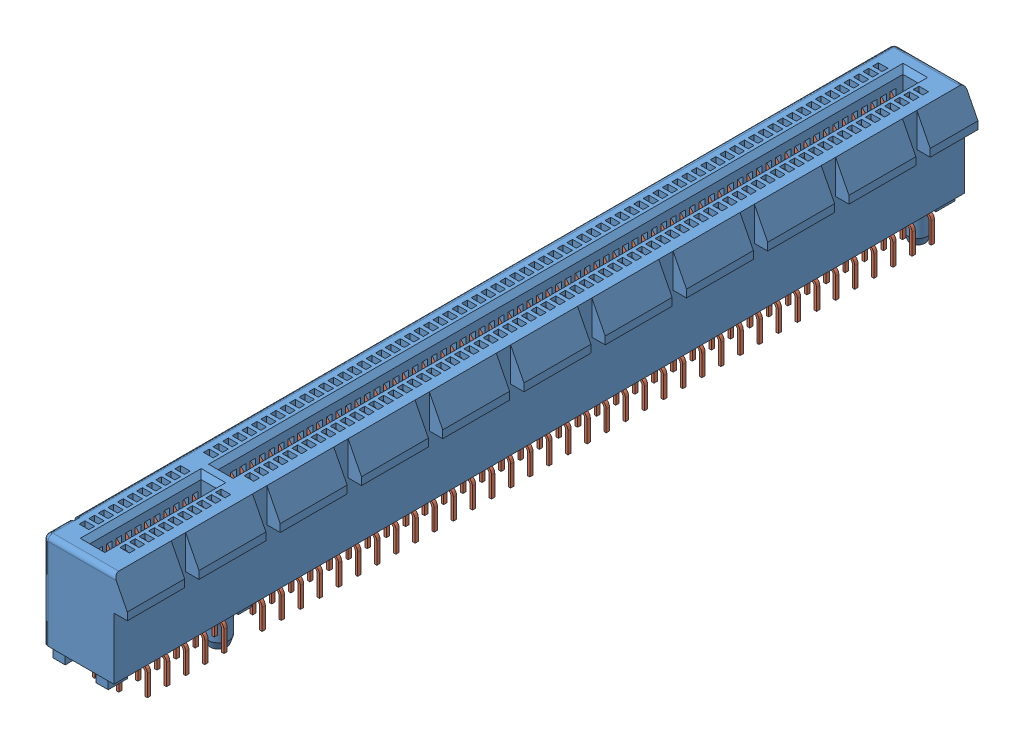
SolidWorks assembly TE PCIe Express Assembly.SLDASM, configuration PCIe x16 (2.3mm Pins) (file format 6000). Lengths in mm.
Overall size (8.8 15.4 89).
165 component instances, 2 part files, 7 mates.
Components (placement in the parent):
- PCIe Body-1: PCIe Body.SLDPRT [PCIe x16] at origin size (8.8 15.4 89)
- Pins-1: Pins.SLDPRT [Internal Pin (Short)] at (2.25 -3.3 85.83) size (1.88 12.9 0.34)
- Pins-2: Pins.SLDPRT [Internal Pin (Short)] at (-2.25 -3.3 86.17) x (-1 0 0) z (0 0 -1) size (1.88 12.9 0.34)
- Pins-3: Pins.SLDPRT [Internal Pin (Short)] at (2.25 -3.3 83.83) size (1.88 12.9 0.34)
- Pins-4: Pins.SLDPRT [Internal Pin (Short)] at (2.25 -3.3 81.83) size (1.88 12.9 0.34)
- Pins-5: Pins.SLDPRT [Internal Pin (Short)] at (2.25 -3.3 79.83) size (1.88 12.9 0.34)
- Pins-6: Pins.SLDPRT [Internal Pin (Short)] at (2.25 -3.3 77.83) size (1.88 12.9 0.34)
- Pins-7: Pins.SLDPRT [Internal Pin (Short)] at (2.25 -3.3 75.83) size (1.88 12.9 0.34)
- Pins-8: Pins.SLDPRT [Internal Pin (Short)] at (2.25 -3.3 71.83) size (1.88 12.9 0.34)
- Pins-9: Pins.SLDPRT [Internal Pin (Short)] at (2.25 -3.3 69.83) size (1.88 12.9 0.34)
- Pins-10: Pins.SLDPRT [Internal Pin (Short)] at (2.25 -3.3 67.83) size (1.88 12.9 0.34)
- Pins-11: Pins.SLDPRT [Internal Pin (Short)] at (-2.25 -3.3 84.17) x (-1 0 0) z (0 0 -1) size (1.88 12.9 0.34)
- Pins-12: Pins.SLDPRT [Internal Pin (Short)] at (-2.25 -3.3 82.17) x (-1 0 0) z (0 0 -1) size (1.88 12.9 0.34)
- Pins-13: Pins.SLDPRT [Internal Pin (Short)] at (-2.25 -3.3 80.17) x (-1 0 0) z (0 0 -1) size (1.88 12.9 0.34)
- Pins-14: Pins.SLDPRT [Internal Pin (Short)] at (-2.25 -3.3 78.17) x (-1 0 0) z (0 0 -1) size (1.88 12.9 0.34)
- Pins-15: Pins.SLDPRT [Internal Pin (Short)] at (-2.25 -3.3 76.17) x (-1 0 0) z (0 0 -1) size (1.88 12.9 0.34)
- Pins-16: Pins.SLDPRT [Internal Pin (Short)] at (-2.25 -3.3 72.17) x (-1 0 0) z (0 0 -1) size (1.88 12.9 0.34)
- Pins-17: Pins.SLDPRT [Internal Pin (Short)] at (-2.25 -3.3 70.17) x (-1 0 0) z (0 0 -1) size (1.88 12.9 0.34)
- Pins-18: Pins.SLDPRT [Internal Pin (Short)] at (-2.25 -3.3 68.17) x (-1 0 0) z (0 0 -1) size (1.88 12.9 0.34)
- Pins-19: Pins.SLDPRT [External Pin (Short)] at (2.25 -3.3 84.83) size (2.88 12.9 0.34)
- Pins-20: Pins.SLDPRT [External Pin (Short)] at (-2.25 -3.3 85.17) x (-1 0 0) z (0 0 -1) size (2.88 12.9 0.34)
- Pins-21: Pins.SLDPRT [External Pin (Short)] at (-2.25 -3.3 83.17) x (-1 0 0) z (0 0 -1) size (2.88 12.9 0.34)
- Pins-22: Pins.SLDPRT [External Pin (Short)] at (-2.25 -3.3 81.17) x (-1 0 0) z (0 0 -1) size (2.88 12.9 0.34)
- Pins-23: Pins.SLDPRT [External Pin (Short)] at (-2.25 -3.3 79.17) x (-1 0 0) z (0 0 -1) size (2.88 12.9 0.34)
- Pins-24: Pins.SLDPRT [External Pin (Short)] at (-2.25 -3.3 77.17) x (-1 0 0) z (0 0 -1) size (2.88 12.9 0.34)
- Pins-25: Pins.SLDPRT [External Pin (Short)] at (-2.25 -3.3 73.17) x (-1 0 0) z (0 0 -1) size (2.88 12.9 0.34)
- Pins-26: Pins.SLDPRT [External Pin (Short)] at (-2.25 -3.3 71.17) x (-1 0 0) z (0 0 -1) size (2.88 12.9 0.34)
- Pins-27: Pins.SLDPRT [External Pin (Short)] at (-2.25 -3.3 69.17) x (-1 0 0) z (0 0 -1) size (2.88 12.9 0.34)
- Pins-28: Pins.SLDPRT [External Pin (Short)] at (-2.25 -3.3 67.17) x (-1 0 0) z (0 0 -1) size (2.88 12.9 0.34)
- Pins-29: Pins.SLDPRT [External Pin (Short)] at (2.25 -3.3 82.83) size (2.88 12.9 0.34)
- Pins-30: Pins.SLDPRT [External Pin (Short)] at (2.25 -3.3 80.83) size (2.88 12.9 0.34)
- Pins-31: Pins.SLDPRT [External Pin (Short)] at (2.25 -3.3 78.83) size (2.88 12.9 0.34)
- Pins-32: Pins.SLDPRT [External Pin (Short)] at (2.25 -3.3 76.83) size (2.88 12.9 0.34)
- Pins-33: Pins.SLDPRT [External Pin (Short)] at (2.25 -3.3 72.83) size (2.88 12.9 0.34)
- Pins-34: Pins.SLDPRT [External Pin (Short)] at (2.25 -3.3 70.83) size (2.88 12.9 0.34)
- Pins-35: Pins.SLDPRT [External Pin (Short)] at (2.25 -3.3 68.83) size (2.88 12.9 0.34)
- Pins-36: Pins.SLDPRT [External Pin (Short)] at (2.25 -3.3 66.83) size (2.88 12.9 0.34)
- Pins-37: Pins.SLDPRT [Internal Pin (Short)] at (-2.25 -3.3 66.17) x (-1 0 0) z (0 0 -1) size (1.88 12.9 0.34)
- Pins-38: Pins.SLDPRT [Internal Pin (Short)] at (-2.25 -3.3 64.17) x (-1 0 0) z (0 0 -1) size (1.88 12.9 0.34)
- Pins-39: Pins.SLDPRT [Internal Pin (Short)] at (-2.25 -3.3 62.17) x (-1 0 0) z (0 0 -1) size (1.88 12.9 0.34)
- Pins-40: Pins.SLDPRT [Internal Pin (Short)] at (-2.25 -3.3 60.17) x (-1 0 0) z (0 0 -1) size (1.88 12.9 0.34)
- Pins-41: Pins.SLDPRT [Internal Pin (Short)] at (-2.25 -3.3 58.17) x (-1 0 0) z (0 0 -1) size (1.88 12.9 0.34)
- Pins-42: Pins.SLDPRT [Internal Pin (Short)] at (-2.25 -3.3 56.17) x (-1 0 0) z (0 0 -1) size (1.88 12.9 0.34)
- Pins-43: Pins.SLDPRT [Internal Pin (Short)] at (-2.25 -3.3 54.17) x (-1 0 0) z (0 0 -1) size (1.88 12.9 0.34)
- Pins-44: Pins.SLDPRT [Internal Pin (Short)] at (2.25 -3.3 65.83) size (1.88 12.9 0.34)
- Pins-45: Pins.SLDPRT [Internal Pin (Short)] at (2.25 -3.3 63.83) size (1.88 12.9 0.34)
- Pins-46: Pins.SLDPRT [Internal Pin (Short)] at (2.25 -3.3 61.83) size (1.88 12.9 0.34)
- Pins-47: Pins.SLDPRT [Internal Pin (Short)] at (2.25 -3.3 59.83) size (1.88 12.9 0.34)
- Pins-48: Pins.SLDPRT [Internal Pin (Short)] at (2.25 -3.3 57.83) size (1.88 12.9 0.34)
- Pins-49: Pins.SLDPRT [Internal Pin (Short)] at (2.25 -3.3 55.83) size (1.88 12.9 0.34)
- Pins-50: Pins.SLDPRT [Internal Pin (Short)] at (2.25 -3.3 53.83) size (1.88 12.9 0.34)
- Pins-51: Pins.SLDPRT [External Pin (Short)] at (2.25 -3.3 64.83) size (2.88 12.9 0.34)
- Pins-52: Pins.SLDPRT [External Pin (Short)] at (2.25 -3.3 62.83) size (2.88 12.9 0.34)
- Pins-53: Pins.SLDPRT [External Pin (Short)] at (2.25 -3.3 60.83) size (2.88 12.9 0.34)
- Pins-54: Pins.SLDPRT [External Pin (Short)] at (2.25 -3.3 58.83) size (2.88 12.9 0.34)
- Pins-55: Pins.SLDPRT [External Pin (Short)] at (2.25 -3.3 56.83) size (2.88 12.9 0.34)
- Pins-56: Pins.SLDPRT [External Pin (Short)] at (2.25 -3.3 54.83) size (2.88 12.9 0.34)
- Pins-57: Pins.SLDPRT [External Pin (Short)] at (2.25 -3.3 52.83) size (2.88 12.9 0.34)
- Pins-58: Pins.SLDPRT [External Pin (Short)] at (-2.25 -3.3 65.17) x (-1 0 0) z (0 0 -1) size (2.88 12.9 0.34)
- Pins-59: Pins.SLDPRT [External Pin (Short)] at (-2.25 -3.3 63.17) x (-1 0 0) z (0 0 -1) size (2.88 12.9 0.34)
- Pins-60: Pins.SLDPRT [External Pin (Short)] at (-2.25 -3.3 61.17) x (-1 0 0) z (0 0 -1) size (2.88 12.9 0.34)
- Pins-61: Pins.SLDPRT [External Pin (Short)] at (-2.25 -3.3 59.17) x (-1 0 0) z (0 0 -1) size (2.88 12.9 0.34)
- Pins-62: Pins.SLDPRT [External Pin (Short)] at (-2.25 -3.3 57.17) x (-1 0 0) z (0 0 -1) size (2.88 12.9 0.34)
- Pins-63: Pins.SLDPRT [External Pin (Short)] at (-2.25 -3.3 55.17) x (-1 0 0) z (0 0 -1) size (2.88 12.9 0.34)
- Pins-64: Pins.SLDPRT [External Pin (Short)] at (-2.25 -3.3 53.17) x (-1 0 0) z (0 0 -1) size (2.88 12.9 0.34)
- Pins-65: Pins.SLDPRT [Internal Pin (Short)] at (-2.25 -3.3 52.17) x (-1 0 0) z (0 0 -1) size (1.88 12.9 0.34)
- Pins-66: Pins.SLDPRT [Internal Pin (Short)] at (-2.25 -3.3 50.17) x (-1 0 0) z (0 0 -1) size (1.88 12.9 0.34)
- Pins-67: Pins.SLDPRT [Internal Pin (Short)] at (-2.25 -3.3 48.17) x (-1 0 0) z (0 0 -1) size (1.88 12.9 0.34)
- Pins-68: Pins.SLDPRT [Internal Pin (Short)] at (-2.25 -3.3 46.17) x (-1 0 0) z (0 0 -1) size (1.88 12.9 0.34)
- Pins-69: Pins.SLDPRT [Internal Pin (Short)] at (-2.25 -3.3 44.17) x (-1 0 0) z (0 0 -1) size (1.88 12.9 0.34)
- Pins-70: Pins.SLDPRT [Internal Pin (Short)] at (-2.25 -3.3 42.17) x (-1 0 0) z (0 0 -1) size (1.88 12.9 0.34)
- Pins-71: Pins.SLDPRT [Internal Pin (Short)] at (-2.25 -3.3 40.17) x (-1 0 0) z (0 0 -1) size (1.88 12.9 0.34)
- Pins-72: Pins.SLDPRT [Internal Pin (Short)] at (-2.25 -3.3 38.17) x (-1 0 0) z (0 0 -1) size (1.88 12.9 0.34)
- Pins-73: Pins.SLDPRT [Internal Pin (Short)] at (-2.25 -3.3 36.17) x (-1 0 0) z (0 0 -1) size (1.88 12.9 0.34)
- Pins-74: Pins.SLDPRT [Internal Pin (Short)] at (2.25 -3.3 51.83) size (1.88 12.9 0.34)
- Pins-75: Pins.SLDPRT [Internal Pin (Short)] at (2.25 -3.3 49.83) size (1.88 12.9 0.34)
- Pins-76: Pins.SLDPRT [Internal Pin (Short)] at (2.25 -3.3 47.83) size (1.88 12.9 0.34)
- Pins-77: Pins.SLDPRT [Internal Pin (Short)] at (2.25 -3.3 45.83) size (1.88 12.9 0.34)
- Pins-78: Pins.SLDPRT [Internal Pin (Short)] at (2.25 -3.3 43.83) size (1.88 12.9 0.34)
- Pins-79: Pins.SLDPRT [Internal Pin (Short)] at (2.25 -3.3 41.83) size (1.88 12.9 0.34)
- Pins-80: Pins.SLDPRT [Internal Pin (Short)] at (2.25 -3.3 39.83) size (1.88 12.9 0.34)
- Pins-81: Pins.SLDPRT [Internal Pin (Short)] at (2.25 -3.3 37.83) size (1.88 12.9 0.34)
- Pins-82: Pins.SLDPRT [Internal Pin (Short)] at (2.25 -3.3 35.83) size (1.88 12.9 0.34)
- Pins-83: Pins.SLDPRT [External Pin (Short)] at (2.25 -3.3 50.83) size (2.88 12.9 0.34)
- Pins-84: Pins.SLDPRT [External Pin (Short)] at (2.25 -3.3 48.83) size (2.88 12.9 0.34)
- Pins-85: Pins.SLDPRT [External Pin (Short)] at (2.25 -3.3 46.83) size (2.88 12.9 0.34)
- Pins-86: Pins.SLDPRT [External Pin (Short)] at (2.25 -3.3 44.83) size (2.88 12.9 0.34)
- Pins-87: Pins.SLDPRT [External Pin (Short)] at (2.25 -3.3 42.83) size (2.88 12.9 0.34)
- Pins-88: Pins.SLDPRT [External Pin (Short)] at (2.25 -3.3 40.83) size (2.88 12.9 0.34)
- Pins-89: Pins.SLDPRT [External Pin (Short)] at (2.25 -3.3 38.83) size (2.88 12.9 0.34)
- Pins-90: Pins.SLDPRT [External Pin (Short)] at (2.25 -3.3 36.83) size (2.88 12.9 0.34)
- Pins-91: Pins.SLDPRT [External Pin (Short)] at (-2.25 -3.3 51.17) x (-1 0 0) z (0 0 -1) size (2.88 12.9 0.34)
- Pins-92: Pins.SLDPRT [External Pin (Short)] at (-2.25 -3.3 49.17) x (-1 0 0) z (0 0 -1) size (2.88 12.9 0.34)
- Pins-93: Pins.SLDPRT [External Pin (Short)] at (-2.25 -3.3 47.17) x (-1 0 0) z (0 0 -1) size (2.88 12.9 0.34)
- Pins-94: Pins.SLDPRT [External Pin (Short)] at (-2.25 -3.3 45.17) x (-1 0 0) z (0 0 -1) size (2.88 12.9 0.34)
- Pins-95: Pins.SLDPRT [External Pin (Short)] at (-2.25 -3.3 43.17) x (-1 0 0) z (0 0 -1) size (2.88 12.9 0.34)
- Pins-96: Pins.SLDPRT [External Pin (Short)] at (-2.25 -3.3 41.17) x (-1 0 0) z (0 0 -1) size (2.88 12.9 0.34)
- Pins-97: Pins.SLDPRT [External Pin (Short)] at (-2.25 -3.3 39.17) x (-1 0 0) z (0 0 -1) size (2.88 12.9 0.34)
- Pins-98: Pins.SLDPRT [External Pin (Short)] at (-2.25 -3.3 37.17) x (-1 0 0) z (0 0 -1) size (2.88 12.9 0.34)
- Pins-99: Pins.SLDPRT [Internal Pin (Short)] at (-2.25 -3.3 34.17) x (-1 0 0) z (0 0 -1) size (1.88 12.9 0.34)
- Pins-100: Pins.SLDPRT [Internal Pin (Short)] at (-2.25 -3.3 32.17) x (-1 0 0) z (0 0 -1) size (1.88 12.9 0.34)
- Pins-101: Pins.SLDPRT [Internal Pin (Short)] at (-2.25 -3.3 30.17) x (-1 0 0) z (0 0 -1) size (1.88 12.9 0.34)
- Pins-102: Pins.SLDPRT [Internal Pin (Short)] at (-2.25 -3.3 28.17) x (-1 0 0) z (0 0 -1) size (1.88 12.9 0.34)
- Pins-103: Pins.SLDPRT [Internal Pin (Short)] at (-2.25 -3.3 26.17) x (-1 0 0) z (0 0 -1) size (1.88 12.9 0.34)
- Pins-104: Pins.SLDPRT [Internal Pin (Short)] at (-2.25 -3.3 24.17) x (-1 0 0) z (0 0 -1) size (1.88 12.9 0.34)
- Pins-105: Pins.SLDPRT [Internal Pin (Short)] at (-2.25 -3.3 22.17) x (-1 0 0) z (0 0 -1) size (1.88 12.9 0.34)
- Pins-106: Pins.SLDPRT [Internal Pin (Short)] at (-2.25 -3.3 20.17) x (-1 0 0) z (0 0 -1) size (1.88 12.9 0.34)
- Pins-107: Pins.SLDPRT [Internal Pin (Short)] at (-2.25 -3.3 18.17) x (-1 0 0) z (0 0 -1) size (1.88 12.9 0.34)
- Pins-108: Pins.SLDPRT [Internal Pin (Short)] at (-2.25 -3.3 16.17) x (-1 0 0) z (0 0 -1) size (1.88 12.9 0.34)
- Pins-109: Pins.SLDPRT [Internal Pin (Short)] at (-2.25 -3.3 14.17) x (-1 0 0) z (0 0 -1) size (1.88 12.9 0.34)
- Pins-110: Pins.SLDPRT [Internal Pin (Short)] at (-2.25 -3.3 12.17) x (-1 0 0) z (0 0 -1) size (1.88 12.9 0.34)
- Pins-111: Pins.SLDPRT [Internal Pin (Short)] at (-2.25 -3.3 10.17) x (-1 0 0) z (0 0 -1) size (1.88 12.9 0.34)
- Pins-112: Pins.SLDPRT [Internal Pin (Short)] at (-2.25 -3.3 8.17) x (-1 0 0) z (0 0 -1) size (1.88 12.9 0.34)
- Pins-113: Pins.SLDPRT [Internal Pin (Short)] at (-2.25 -3.3 6.17) x (-1 0 0) z (0 0 -1) size (1.88 12.9 0.34)
- Pins-114: Pins.SLDPRT [Internal Pin (Short)] at (-2.25 -3.3 4.17) x (-1 0 0) z (0 0 -1) size (1.88 12.9 0.34)
- Pins-115: Pins.SLDPRT [Internal Pin (Short)] at (2.25 -3.3 33.83) size (1.88 12.9 0.34)
- Pins-116: Pins.SLDPRT [Internal Pin (Short)] at (2.25 -3.3 31.83) size (1.88 12.9 0.34)
- Pins-117: Pins.SLDPRT [Internal Pin (Short)] at (2.25 -3.3 29.83) size (1.88 12.9 0.34)
- Pins-118: Pins.SLDPRT [Internal Pin (Short)] at (2.25 -3.3 27.83) size (1.88 12.9 0.34)
- Pins-119: Pins.SLDPRT [Internal Pin (Short)] at (2.25 -3.3 25.83) size (1.88 12.9 0.34)
- Pins-120: Pins.SLDPRT [Internal Pin (Short)] at (2.25 -3.3 23.83) size (1.88 12.9 0.34)
- Pins-121: Pins.SLDPRT [Internal Pin (Short)] at (2.25 -3.3 21.83) size (1.88 12.9 0.34)
- Pins-122: Pins.SLDPRT [Internal Pin (Short)] at (2.25 -3.3 19.83) size (1.88 12.9 0.34)
- Pins-123: Pins.SLDPRT [Internal Pin (Short)] at (2.25 -3.3 17.83) size (1.88 12.9 0.34)
- Pins-124: Pins.SLDPRT [Internal Pin (Short)] at (2.25 -3.3 15.83) size (1.88 12.9 0.34)
- Pins-125: Pins.SLDPRT [Internal Pin (Short)] at (2.25 -3.3 13.83) size (1.88 12.9 0.34)
- Pins-126: Pins.SLDPRT [Internal Pin (Short)] at (2.25 -3.3 11.83) size (1.88 12.9 0.34)
- Pins-127: Pins.SLDPRT [Internal Pin (Short)] at (2.25 -3.3 9.83) size (1.88 12.9 0.34)
- Pins-128: Pins.SLDPRT [Internal Pin (Short)] at (2.25 -3.3 7.83) size (1.88 12.9 0.34)
- Pins-129: Pins.SLDPRT [Internal Pin (Short)] at (2.25 -3.3 5.83) size (1.88 12.9 0.34)
- Pins-130: Pins.SLDPRT [Internal Pin (Short)] at (2.25 -3.3 3.83) size (1.88 12.9 0.34)
- Pins-131: Pins.SLDPRT [External Pin (Short)] at (2.25 -3.3 34.83) size (2.88 12.9 0.34)
- Pins-132: Pins.SLDPRT [External Pin (Short)] at (2.25 -3.3 32.83) size (2.88 12.9 0.34)
- Pins-133: Pins.SLDPRT [External Pin (Short)] at (2.25 -3.3 30.83) size (2.88 12.9 0.34)
- Pins-134: Pins.SLDPRT [External Pin (Short)] at (2.25 -3.3 28.83) size (2.88 12.9 0.34)
- Pins-135: Pins.SLDPRT [External Pin (Short)] at (2.25 -3.3 26.83) size (2.88 12.9 0.34)
- Pins-136: Pins.SLDPRT [External Pin (Short)] at (2.25 -3.3 24.83) size (2.88 12.9 0.34)
- Pins-137: Pins.SLDPRT [External Pin (Short)] at (2.25 -3.3 22.83) size (2.88 12.9 0.34)
- Pins-138: Pins.SLDPRT [External Pin (Short)] at (2.25 -3.3 20.83) size (2.88 12.9 0.34)
- Pins-139: Pins.SLDPRT [External Pin (Short)] at (2.25 -3.3 18.83) size (2.88 12.9 0.34)
- Pins-140: Pins.SLDPRT [External Pin (Short)] at (2.25 -3.3 16.83) size (2.88 12.9 0.34)
- Pins-141: Pins.SLDPRT [External Pin (Short)] at (2.25 -3.3 14.83) size (2.88 12.9 0.34)
- Pins-142: Pins.SLDPRT [External Pin (Short)] at (2.25 -3.3 12.83) size (2.88 12.9 0.34)
- Pins-143: Pins.SLDPRT [External Pin (Short)] at (2.25 -3.3 10.83) size (2.88 12.9 0.34)
- Pins-144: Pins.SLDPRT [External Pin (Short)] at (2.25 -3.3 8.83) size (2.88 12.9 0.34)
- Pins-145: Pins.SLDPRT [External Pin (Short)] at (2.25 -3.3 6.83) size (2.88 12.9 0.34)
- Pins-146: Pins.SLDPRT [External Pin (Short)] at (2.25 -3.3 4.83) size (2.88 12.9 0.34)
- Pins-147: Pins.SLDPRT [External Pin (Short)] at (2.25 -3.3 2.83) size (2.88 12.9 0.34)
- Pins-148: Pins.SLDPRT [External Pin (Short)] at (-2.25 -3.3 35.17) x (-1 0 0) z (0 0 -1) size (2.88 12.9 0.34)
- Pins-149: Pins.SLDPRT [External Pin (Short)] at (-2.25 -3.3 33.17) x (-1 0 0) z (0 0 -1) size (2.88 12.9 0.34)
- Pins-150: Pins.SLDPRT [External Pin (Short)] at (-2.25 -3.3 31.17) x (-1 0 0) z (0 0 -1) size (2.88 12.9 0.34)
- Pins-151: Pins.SLDPRT [External Pin (Short)] at (-2.25 -3.3 29.17) x (-1 0 0) z (0 0 -1) size (2.88 12.9 0.34)
- Pins-152: Pins.SLDPRT [External Pin (Short)] at (-2.25 -3.3 27.17) x (-1 0 0) z (0 0 -1) size (2.88 12.9 0.34)
- Pins-153: Pins.SLDPRT [External Pin (Short)] at (-2.25 -3.3 25.17) x (-1 0 0) z (0 0 -1) size (2.88 12.9 0.34)
- Pins-154: Pins.SLDPRT [External Pin (Short)] at (-2.25 -3.3 23.17) x (-1 0 0) z (0 0 -1) size (2.88 12.9 0.34)
- Pins-155: Pins.SLDPRT [External Pin (Short)] at (-2.25 -3.3 21.17) x (-1 0 0) z (0 0 -1) size (2.88 12.9 0.34)
- Pins-156: Pins.SLDPRT [External Pin (Short)] at (-2.25 -3.3 19.17) x (-1 0 0) z (0 0 -1) size (2.88 12.9 0.34)
- Pins-157: Pins.SLDPRT [External Pin (Short)] at (-2.25 -3.3 17.17) x (-1 0 0) z (0 0 -1) size (2.88 12.9 0.34)
- Pins-158: Pins.SLDPRT [External Pin (Short)] at (-2.25 -3.3 15.17) x (-1 0 0) z (0 0 -1) size (2.88 12.9 0.34)
- Pins-159: Pins.SLDPRT [External Pin (Short)] at (-2.25 -3.3 13.17) x (-1 0 0) z (0 0 -1) size (2.88 12.9 0.34)
- Pins-160: Pins.SLDPRT [External Pin (Short)] at (-2.25 -3.3 11.17) x (-1 0 0) z (0 0 -1) size (2.88 12.9 0.34)
- Pins-161: Pins.SLDPRT [External Pin (Short)] at (-2.25 -3.3 9.17) x (-1 0 0) z (0 0 -1) size (2.88 12.9 0.34)
- Pins-162: Pins.SLDPRT [External Pin (Short)] at (-2.25 -3.3 7.17) x (-1 0 0) z (0 0 -1) size (2.88 12.9 0.34)
- Pins-163: Pins.SLDPRT [External Pin (Short)] at (-2.25 -3.3 5.17) x (-1 0 0) z (0 0 -1) size (2.88 12.9 0.34)
- Pins-164: Pins.SLDPRT [External Pin (Short)] at (-2.25 -3.3 3.17) x (-1 0 0) z (0 0 -1) size (2.88 12.9 0.34)
Mates (geometry in assembly coordinates):
- Width1: width anti-aligned: plane of Pins-1 through (1.75 -1.125 86.17) normal (0 0 1); plane of Pins-1 through (1.75 -1.125 85.83) normal (0 0 -1); plane of PCIe Body-1 through (1.625 5.25 86.3) normal (0 0 -1); plane of PCIe Body-1 through (1.625 5.25 85.7) normal (0 0 1)
- Coincident1: coincident anti-aligned: plane of PCIe Body-1 through (2.375 0 85.7) normal (-1 0 0); plane of Pins-1 through (2.375 2.8 86.17) normal (1 0 0)
- Distance1: distance = 2.3 mm aligned: plane of Pins-1 through (1.125 -3.3 86.17) normal (0 -1 0); plane of PCIe Body-1 through (0 -1 0) normal (0 -1 0)
- Width2: width anti-aligned: plane of Pins-19 through (2.75 -1.125 85.17) normal (0 0 1); plane of Pins-19 through (2.75 -1.125 84.83) normal (0 0 -1); plane of PCIe Body-1 through (1.625 5.25 85.3) normal (0 0 -1); plane of PCIe Body-1 through (1.625 5.25 84.7) normal (0 0 1)
- Coincident3: coincident anti-aligned: plane of PCIe Body-1 through (2.375 0 84.7) normal (-1 0 0); plane of Pins-19 through (2.375 2.8 85.17) normal (1 0 0)
- Coincident4: coincident aligned: plane of Pins-1 through (1.125 -3.3 86.17) normal (0 -1 0); plane of Pins-19 through (3.125 -3.3 85.17) normal (0 -1 0)
- Distance2: distance = 3.1 mm aligned: plane of PCIe Body-1 through (0 -1 0) normal (0 -1 0); plane of Pins-1 through (1.125 -4.1 22.17) normal (0 -1 0)
